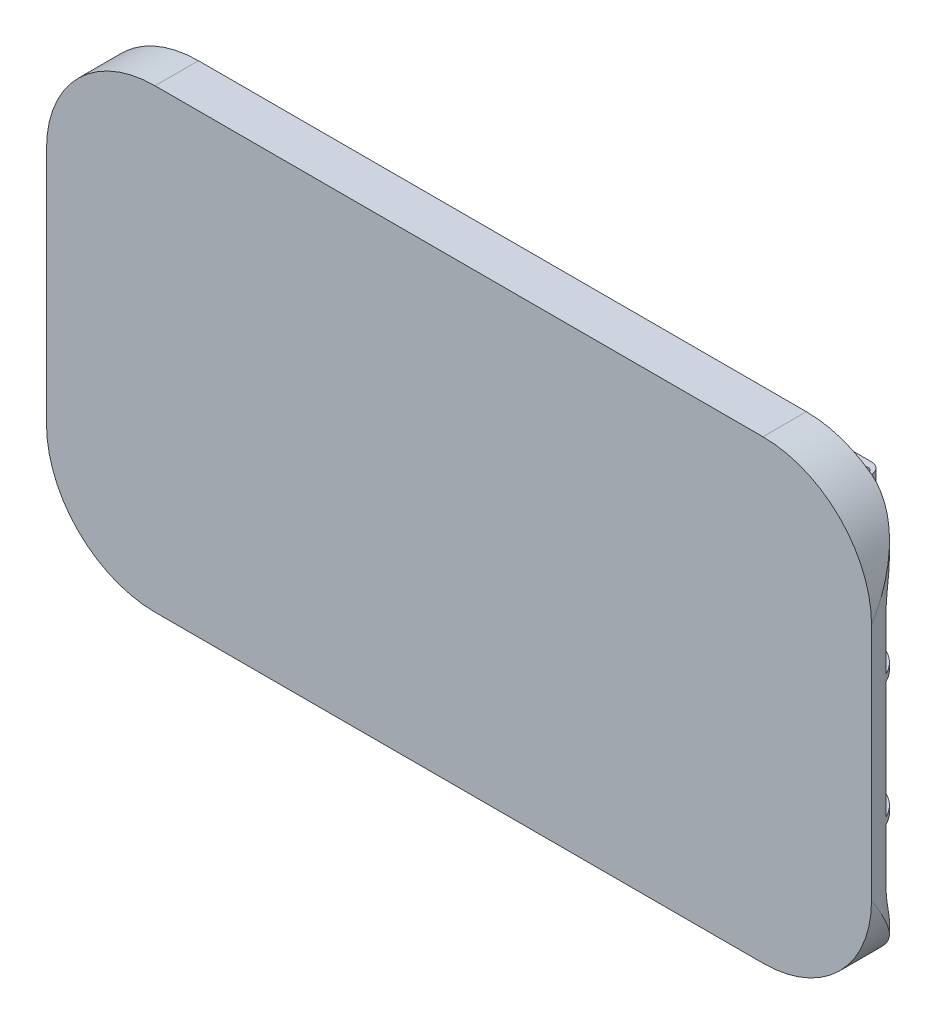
from build123d import *

# Parameters (mm, degrees)
SKETCH1_W                        = 380
SKETCH1_H                        = 160
BOSS_EXTRUDE1_DEPTH              = 3
SKETCH3_W                        = 25
SKETCH3_H                        = 40
SKETCH3_R                        = 2
BOSS_EXTRUDE2_DEPTH              = 5
BOSS_EXTRUDE3_START              = -5
SKETCH4_W                        = 25
SKETCH4_H                        = 40
SKETCH4_R                        = 2
BOSS_EXTRUDE3_DEPTH              = 5
FILLET1_R                        = 5
SKETCH5_W                        = 4
SKETCH5_H                        = 150
BOSS_EXTRUDE4_DEPTH              = 15
CHAMFER1_SIZE                    = 7
SKETCH6_W                        = 380
SKETCH6_H                        = 3
BOSS_EXTRUDE5_DEPTH              = 15
SKETCH7_W                        = 380
SKETCH7_H                        = 210
BOSS_EXTRUDE6_DEPTH              = 3
FILLET3_R                        = 50
BOSS_EXTRUDE7_START              = -20
BOSS_EXTRUDE7_DEPTH              = 20
CUT_EXTRUDE1_DEPTH               = 286.602871
BOSS_EXTRUDE10_REACH             = 237.996
BOSS_EXTRUDE10_DIRECTION_2_REACH = 237.996


with BuildPart() as part:
    # Sketch1 → Boss-Extrude1 (new body)
    with BuildSketch(Plane.XY):
        with Locations((0, 10)):
            Rectangle(SKETCH1_W, SKETCH1_H)
    extrude(amount=BOSS_EXTRUDE1_DEPTH)

    # Sketch3 → Boss-Extrude2 (add)
    # profile 1 of 4: a face of its own
    with BuildSketch(Plane.XZ.offset(70)):
        with Locations((-142.5, -17)):
            Rectangle(SKETCH3_W, SKETCH3_H)
        with Locations(Location((-151.5, -32, 0), (0, 0, 270))):
            Circle(SKETCH3_R, mode=Mode.SUBTRACT)
        with Locations(Location((-133.5, -32, 0), (0, 0, 270))):
            Circle(SKETCH3_R, mode=Mode.SUBTRACT)
    # profile 2 of 4: a face of its own
    with BuildSketch(Plane.XZ.offset(70)):
        with Locations((-47.5, -17)):
            Rectangle(SKETCH3_W, SKETCH3_H)
        with Locations(Location((-56.5, -32, 0), (0, 0, 90))):
            Circle(SKETCH3_R, mode=Mode.SUBTRACT)
        with Locations(Location((-38.5, -32, 0), (0, 0, 90))):
            Circle(SKETCH3_R, mode=Mode.SUBTRACT)
    # profile 3 of 4: a face of its own
    with BuildSketch(Plane.XZ.offset(70)):
        with Locations((47.5, -17)):
            Rectangle(SKETCH3_W, SKETCH3_H)
        with Locations(Location((38.5, -32, 0), (0, 0, 270))):
            Circle(SKETCH3_R, mode=Mode.SUBTRACT)
        with Locations(Location((56.5, -32, 0), (0, 0, 270))):
            Circle(SKETCH3_R, mode=Mode.SUBTRACT)
    # profile 4 of 4: a face of its own
    with BuildSketch(Plane.XZ.offset(70)):
        with Locations((142.5, -17)):
            Rectangle(SKETCH3_W, SKETCH3_H)
        with Locations(Location((133.5, -32, 0), (0, 0, 90))):
            Circle(SKETCH3_R, mode=Mode.SUBTRACT)
        with Locations(Location((151.5, -32, 0), (0, 0, 90))):
            Circle(SKETCH3_R, mode=Mode.SUBTRACT)
    extrude(amount=-BOSS_EXTRUDE2_DEPTH)

    # Sketch4 → Boss-Extrude3 (add)
    # profile 1 of 4: a face of its own
    with BuildSketch(Plane(origin=(0, 90, 0), x_dir=(1, 0, 0), z_dir=(0, 1, 0)).offset(BOSS_EXTRUDE3_START)):
        with Locations((-142.5, 17)):
            Rectangle(SKETCH4_W, SKETCH4_H)
        with Locations(Location((-133.5, 32, 0), (0, 0, 90))):
            Circle(SKETCH4_R, mode=Mode.SUBTRACT)
        with Locations(Location((-151.5, 32, 0), (0, 0, 90))):
            Circle(SKETCH4_R, mode=Mode.SUBTRACT)
    # profile 2 of 4: a face of its own
    with BuildSketch(Plane(origin=(0, 90, 0), x_dir=(1, 0, 0), z_dir=(0, 1, 0)).offset(BOSS_EXTRUDE3_START)):
        with Locations((-47.5, 17)):
            Rectangle(SKETCH4_W, SKETCH4_H)
        with Locations(Location((-38.5, 32, 0), (0, 0, 270))):
            Circle(SKETCH4_R, mode=Mode.SUBTRACT)
        with Locations(Location((-56.5, 32, 0), (0, 0, 270))):
            Circle(SKETCH4_R, mode=Mode.SUBTRACT)
    # profile 3 of 4: a face of its own
    with BuildSketch(Plane(origin=(0, 90, 0), x_dir=(1, 0, 0), z_dir=(0, 1, 0)).offset(BOSS_EXTRUDE3_START)):
        with Locations((142.5, 17)):
            Rectangle(SKETCH4_W, SKETCH4_H)
        with Locations(Location((151.5, 32, 0), (0, 0, 270))):
            Circle(SKETCH4_R, mode=Mode.SUBTRACT)
        with Locations(Location((133.5, 32, 0), (0, 0, 270))):
            Circle(SKETCH4_R, mode=Mode.SUBTRACT)
    # profile 4 of 4: a face of its own
    with BuildSketch(Plane(origin=(0, 90, 0), x_dir=(1, 0, 0), z_dir=(0, 1, 0)).offset(BOSS_EXTRUDE3_START)):
        with Locations((47.5, 17)):
            Rectangle(SKETCH4_W, SKETCH4_H)
        with Locations(Location((56.5, 32, 0), (0, 0, 90))):
            Circle(SKETCH4_R, mode=Mode.SUBTRACT)
        with Locations(Location((38.5, 32, 0), (0, 0, 90))):
            Circle(SKETCH4_R, mode=Mode.SUBTRACT)
    extrude(amount=BOSS_EXTRUDE3_DEPTH)

    # Fillet1
    fillet1_edges = [part.edges().sort_by_distance(p)[0] for p in [
        (-130, 87.5, 0),
        (-155, 87.5, 0),
        (-130, 87.5, -37),
        (-155, 87.5, -37),
        (-35, 87.5, 0),
        (-60, 87.5, 0),
        (-35, 87.5, -37),
        (-60, 87.5, -37),
        (-130, -67.5, 0),
        (-155, -67.5, 0),
        (155, 87.5, 0),
        (130, 87.5, 0),
        (155, 87.5, -37),
        (130, 87.5, -37),
        (60, 87.5, 0),
        (35, 87.5, 0),
        (-155, -67.5, -37),
        (60, 87.5, -37),
        (35, 87.5, -37),
        (-130, -67.5, -37),
        (-60, -67.5, 0),
        (-35, -67.5, 0),
        (-60, -67.5, -37),
        (-35, -67.5, -37),
        (60, -67.5, 0),
        (35, -67.5, 0),
        (35, -67.5, -37),
        (60, -67.5, -37),
        (130, -67.5, 0),
        (155, -67.5, 0),
        (130, -67.5, -37),
        (155, -67.5, -37),
    ]]
    fillet(fillet1_edges, radius=FILLET1_R)

    # Sketch5 → Boss-Extrude4 (add)
    with BuildSketch(Plane(origin=(0, 0, 0), x_dir=(-1, 0, 0), z_dir=(0, 0, -1))):
        with Locations((142.5, 10)):
            Rectangle(SKETCH5_W, SKETCH5_H)
        with Locations((47.5, 10)):
            Rectangle(SKETCH5_W, SKETCH5_H)
        with Locations((-47.5, 10)):
            Rectangle(SKETCH5_W, SKETCH5_H)
        with Locations((-142.5, 10)):
            Rectangle(SKETCH5_W, SKETCH5_H)
    extrude(amount=BOSS_EXTRUDE4_DEPTH)

    # Chamfer1
    chamfer1_edges = [part.edges().sort_by_distance(p)[0] for p in [
        (-142.5, 85, -15),
        (-142.5, -65, -15),
        (-47.5, 85, -15),
        (-47.5, -65, -15),
        (47.5, -65, -15),
        (47.5, 85, -15),
        (142.5, -65, -15),
        (142.5, 85, -15),
    ]]
    chamfer(chamfer1_edges, length=CHAMFER1_SIZE)

    # Sketch6 → Boss-Extrude5 (add)
    with BuildSketch(Plane(origin=(0, 0, 0), x_dir=(-1, 0, 0), z_dir=(0, 0, -1))):
        with Locations((0, -18.5)):
            Rectangle(SKETCH6_W, SKETCH6_H)
        with Locations((0, 38.5)):
            Rectangle(SKETCH6_W, SKETCH6_H)
    extrude(amount=BOSS_EXTRUDE5_DEPTH)

    # Sketch7 → Boss-Extrude6 (add)
    with BuildSketch(Plane.XY.offset(3)):
        with Locations((0, 10)):
            Rectangle(SKETCH7_W, SKETCH7_H)
    extrude(amount=-BOSS_EXTRUDE6_DEPTH)

    # Fillet3
    fillet3_edges = [part.edges().sort_by_distance(p)[0] for p in [
        (-190, -95, 1.5),
        (190, 115, 1.5),
        (-190, 115, 1.5),
        (190, -95, 1.5),
    ]]
    fillet(fillet3_edges, radius=FILLET3_R)

    # Sketch8 → Boss-Extrude7 (add)
    with BuildSketch(Plane.XY.offset(3).offset(BOSS_EXTRUDE7_START)):
        with BuildLine():
            Line((-140, -95), (140, -95))
            ThreePointArc((140, -95), (175.355339, -80.355339), (190, -45))
            Line((190, -45), (190, 65))
            ThreePointArc((190, 65), (175.355339, 100.355339), (140, 115))
            Line((140, 115), (-140, 115))
            ThreePointArc((-140, 115), (-175.355339, 100.355339), (-190, 65))
            Line((-190, 65), (-190, -45))
            ThreePointArc((-190, -45), (-175.355339, -80.355339), (-140, -95))
        make_face()
        with BuildLine():
            Line((-140, -93), (140, -93))
            ThreePointArc((140, -93), (173.941125, -78.941125), (188, -45))
            Line((188, -45), (188, 65))
            ThreePointArc((188, 65), (173.941125, 98.941125), (140, 113))
            Line((140, 113), (-140, 113))
            ThreePointArc((-140, 113), (-173.941125, 98.941125), (-188, 65))
            Line((-188, 65), (-188, -45))
            ThreePointArc((-188, -45), (-173.941125, -78.941125), (-140, -93))
        make_face(mode=Mode.SUBTRACT)
    extrude(amount=BOSS_EXTRUDE7_DEPTH)

    # Sketch9 → Cut-Extrude1 (cut, through all)
    with BuildSketch(Plane(origin=(0, -95, 0), x_dir=(-1, 0, 0), z_dir=(0, -1, 0))):
        with BuildLine():
            Line((190, -3), (190, 17))
            Line((190, 17), (170, 17))
            ThreePointArc((170, 17), (184.142136, 11.142136), (190, -3))
        make_face()
        with BuildLine():
            Line((-190, 17), (-170, 17))
            ThreePointArc((-170, 17), (-184.142136, 11.142136), (-190, -3))
            Line((-190, -3), (-190, 17))
        make_face()
    extrude(amount=-CUT_EXTRUDE1_DEPTH, mode=Mode.SUBTRACT)

    # Sketch10 → Boss-Extrude10 (add, up to next)
    with BuildSketch(Plane.XZ.offset(20), mode=Mode.PRIVATE) as boss_extrude10_sk1:
        with BuildLine():
            Line((-170, -17), (-170, -15))
            ThreePointArc((-170, -15), (-179.559594, -12.251694), (-186.2, -4.846018))
            Line((-186.2, -4.846018), (-186.2, 0))
            Line((-186.2, 0), (-188, 0))
            Line((-188, 0), (-188, -5.717798))
            ThreePointArc((-188, -5.717798), (-180.621771, -13.946326), (-170, -17))
        make_face()
    boss_extrude10_tool1 = extrude(boss_extrude10_sk1.sketch, amount=BOSS_EXTRUDE10_REACH, mode=Mode.PRIVATE) - part.part
    add(boss_extrude10_tool1.solids().sort_by_distance((-180.49028, -20, -13.736541))[0])

    # Sketch10 → Boss-Extrude10 direction 2 (add, up to next)
    with BuildSketch(Plane.XZ.offset(20), mode=Mode.PRIVATE) as boss_extrude10_direction_2_sk1:
        with BuildLine():
            Line((-170, -17), (-170, -15))
            ThreePointArc((-170, -15), (-179.559594, -12.251694), (-186.2, -4.846018))
            Line((-186.2, -4.846018), (-186.2, 0))
            Line((-186.2, 0), (-188, 0))
            Line((-188, 0), (-188, -5.717798))
            ThreePointArc((-188, -5.717798), (-180.621771, -13.946326), (-170, -17))
        make_face()
    boss_extrude10_direction_2_tool1 = extrude(boss_extrude10_direction_2_sk1.sketch, amount=-BOSS_EXTRUDE10_DIRECTION_2_REACH, mode=Mode.PRIVATE) - part.part
    add(boss_extrude10_direction_2_tool1.solids().sort_by_distance((-180.49028, -20, -13.736541))[0])


solid = part.part
